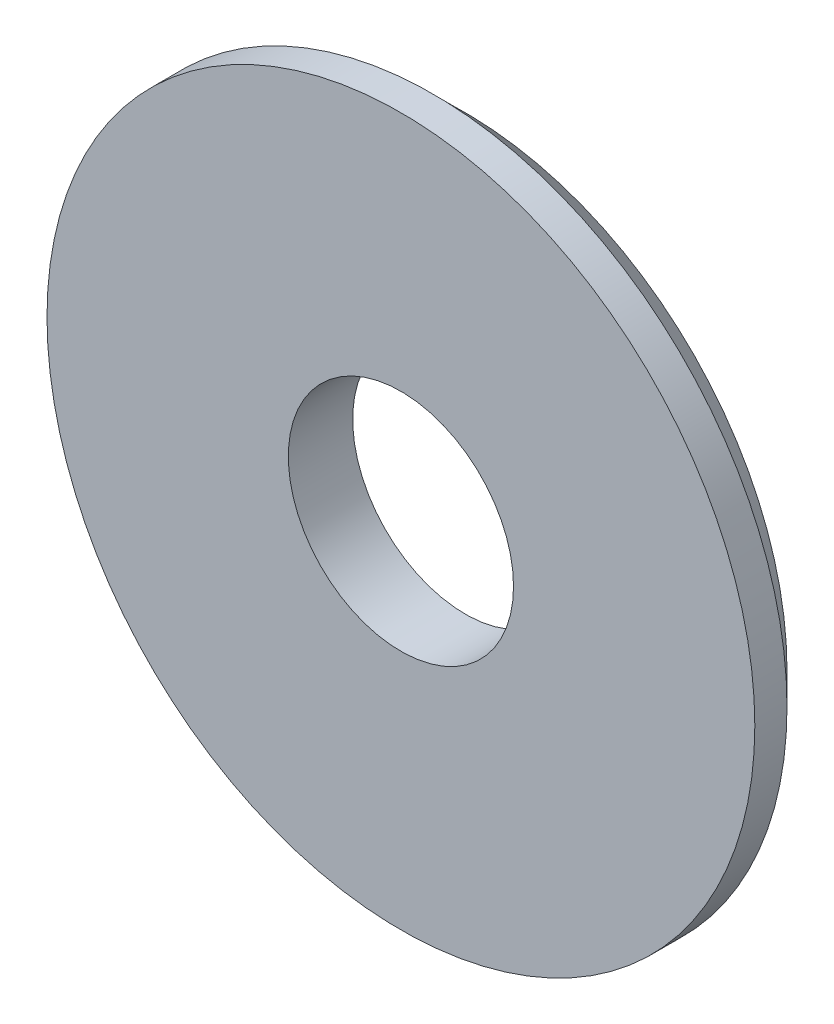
ISO-10303-21;
HEADER;
FILE_DESCRIPTION(('STEP AP214'),'2;1');
FILE_NAME('part.step','',(''),(''),'','','');
FILE_SCHEMA(('AUTOMOTIVE_DESIGN { 1 0 10303 214 1 1 1 1 }'));
ENDSEC;
DATA;
#1=APPLICATION_CONTEXT('core data for automotive mechanical design processes');
#2=APPLICATION_PROTOCOL_DEFINITION('international standard','automotive_design',2000,#1);
#3=PRODUCT_CONTEXT('',#1,'mechanical');
#4=PRODUCT('Part','Part','',(#3));
#5=PRODUCT_RELATED_PRODUCT_CATEGORY('part','',(#4));
#6=PRODUCT_DEFINITION_FORMATION('','',#4);
#7=PRODUCT_DEFINITION_CONTEXT('part definition',#1,'design');
#8=PRODUCT_DEFINITION('design','',#6,#7);
#9=PRODUCT_DEFINITION_SHAPE('','',#8);
#10=(LENGTH_UNIT() NAMED_UNIT(*) SI_UNIT(.MILLI.,.METRE.));
#11=(NAMED_UNIT(*) PLANE_ANGLE_UNIT() SI_UNIT($,.RADIAN.));
#12=(NAMED_UNIT(*) SI_UNIT($,.STERADIAN.) SOLID_ANGLE_UNIT());
#13=UNCERTAINTY_MEASURE_WITH_UNIT(LENGTH_MEASURE(1.E-05),#10,'distance_accuracy_value','');
#14=(GEOMETRIC_REPRESENTATION_CONTEXT(3) GLOBAL_UNCERTAINTY_ASSIGNED_CONTEXT((#13)) GLOBAL_UNIT_ASSIGNED_CONTEXT((#10,
#11,#12)) REPRESENTATION_CONTEXT('',''));
#15=CARTESIAN_POINT('',(0.,0.,0.));
#16=DIRECTION('',(0.,0.,1.));
#17=DIRECTION('',(1.,0.,0.));
#18=AXIS2_PLACEMENT_3D('',#15,#16,#17);
#19=CARTESIAN_POINT('',(0.,0.,2.));
#20=DIRECTION('',(0.,0.,1.));
#21=DIRECTION('',(1.,0.,0.));
#22=AXIS2_PLACEMENT_3D('',#19,#20,#21);
#23=PLANE('',#22);
#24=CARTESIAN_POINT('',(0.,0.,2.));
#25=DIRECTION('',(0.,0.,1.));
#26=DIRECTION('',(1.,0.,0.));
#27=AXIS2_PLACEMENT_3D('',#24,#25,#26);
#28=CIRCLE('',#27,11.);
#29=CARTESIAN_POINT('',(11.,0.,2.));
#30=VERTEX_POINT('',#29);
#31=EDGE_CURVE('E39',#30,#30,#28,.T.);
#32=ORIENTED_EDGE('',*,*,#31,.T.);
#33=EDGE_LOOP('',(#32));
#34=FACE_BOUND('',#33,.T.);
#35=CARTESIAN_POINT('',(0.,0.,2.));
#36=DIRECTION('',(0.,0.,1.));
#37=DIRECTION('',(1.,0.,0.));
#38=AXIS2_PLACEMENT_3D('',#35,#36,#37);
#39=CIRCLE('',#38,3.5);
#40=CARTESIAN_POINT('',(3.5,0.,2.));
#41=VERTEX_POINT('',#40);
#42=EDGE_CURVE('E43',#41,#41,#39,.T.);
#43=ORIENTED_EDGE('',*,*,#42,.F.);
#44=EDGE_LOOP('',(#43));
#45=FACE_BOUND('',#44,.T.);
#46=ADVANCED_FACE('F28',(#34,#45),#23,.T.);
#47=CARTESIAN_POINT('',(0.,0.,0.));
#48=DIRECTION('',(0.,0.,1.));
#49=DIRECTION('',(1.,0.,0.));
#50=AXIS2_PLACEMENT_3D('',#47,#48,#49);
#51=PLANE('',#50);
#52=CARTESIAN_POINT('',(0.,0.,0.));
#53=DIRECTION('',(0.,0.,1.));
#54=DIRECTION('',(1.,0.,0.));
#55=AXIS2_PLACEMENT_3D('',#52,#53,#54);
#56=CIRCLE('',#55,9.99999999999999);
#57=CARTESIAN_POINT('',(9.99999999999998,0.,0.));
#58=VERTEX_POINT('',#57);
#59=EDGE_CURVE('E10',#58,#58,#56,.F.);
#60=ORIENTED_EDGE('',*,*,#59,.T.);
#61=EDGE_LOOP('',(#60));
#62=FACE_BOUND('',#61,.T.);
#63=CARTESIAN_POINT('',(0.,0.,0.));
#64=DIRECTION('',(0.,0.,1.));
#65=DIRECTION('',(1.,0.,0.));
#66=AXIS2_PLACEMENT_3D('',#63,#64,#65);
#67=CIRCLE('',#66,3.5);
#68=CARTESIAN_POINT('',(3.49999999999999,0.,0.));
#69=VERTEX_POINT('',#68);
#70=EDGE_CURVE('E48',#69,#69,#67,.T.);
#71=ORIENTED_EDGE('',*,*,#70,.T.);
#72=EDGE_LOOP('',(#71));
#73=FACE_BOUND('',#72,.T.);
#74=ADVANCED_FACE('F52',(#62,#73),#51,.F.);
#75=CARTESIAN_POINT('',(0.,0.,2.));
#76=DIRECTION('',(0.,0.,-1.));
#77=DIRECTION('',(-1.,0.,0.));
#78=AXIS2_PLACEMENT_3D('',#75,#76,#77);
#79=CYLINDRICAL_SURFACE('',#78,11.);
#80=CARTESIAN_POINT('',(0.,0.,1.00000000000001));
#81=DIRECTION('',(0.,0.,1.));
#82=DIRECTION('',(1.,0.,0.));
#83=AXIS2_PLACEMENT_3D('',#80,#81,#82);
#84=CIRCLE('',#83,11.);
#85=CARTESIAN_POINT('',(11.,0.,1.00000000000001));
#86=VERTEX_POINT('',#85);
#87=EDGE_CURVE('E35',#86,#86,#84,.T.);
#88=ORIENTED_EDGE('',*,*,#87,.T.);
#89=EDGE_LOOP('',(#88));
#90=FACE_BOUND('',#89,.T.);
#91=ORIENTED_EDGE('',*,*,#31,.F.);
#92=EDGE_LOOP('',(#91));
#93=FACE_BOUND('',#92,.T.);
#94=ADVANCED_FACE('F30',(#90,#93),#79,.T.);
#95=CARTESIAN_POINT('',(0.,0.,2.));
#96=DIRECTION('',(0.,0.,-1.));
#97=DIRECTION('',(-1.,0.,0.));
#98=AXIS2_PLACEMENT_3D('',#95,#96,#97);
#99=CYLINDRICAL_SURFACE('',#98,3.5);
#100=ORIENTED_EDGE('',*,*,#42,.T.);
#101=EDGE_LOOP('',(#100));
#102=FACE_BOUND('',#101,.T.);
#103=ORIENTED_EDGE('',*,*,#70,.F.);
#104=EDGE_LOOP('',(#103));
#105=FACE_BOUND('',#104,.T.);
#106=ADVANCED_FACE('F54',(#102,#105),#99,.F.);
#107=CARTESIAN_POINT('',(0.,0.,1.00000000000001));
#108=DIRECTION('',(0.,0.,1.));
#109=DIRECTION('',(1.,0.,0.));
#110=AXIS2_PLACEMENT_3D('',#107,#108,#109);
#111=CONICAL_SURFACE('',#110,11.,0.785398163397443);
#112=ORIENTED_EDGE('',*,*,#59,.F.);
#113=EDGE_LOOP('',(#112));
#114=FACE_BOUND('',#113,.T.);
#115=ORIENTED_EDGE('',*,*,#87,.F.);
#116=EDGE_LOOP('',(#115));
#117=FACE_BOUND('',#116,.T.);
#118=ADVANCED_FACE('F56',(#114,#117),#111,.T.);
#119=CLOSED_SHELL('',(#46,#74,#94,#106,#118));
#120=MANIFOLD_SOLID_BREP('B2',#119);
#121=ADVANCED_BREP_SHAPE_REPRESENTATION('',(#18,#120),#14);
#122=SHAPE_DEFINITION_REPRESENTATION(#9,#121);
ENDSEC;
END-ISO-10303-21;
